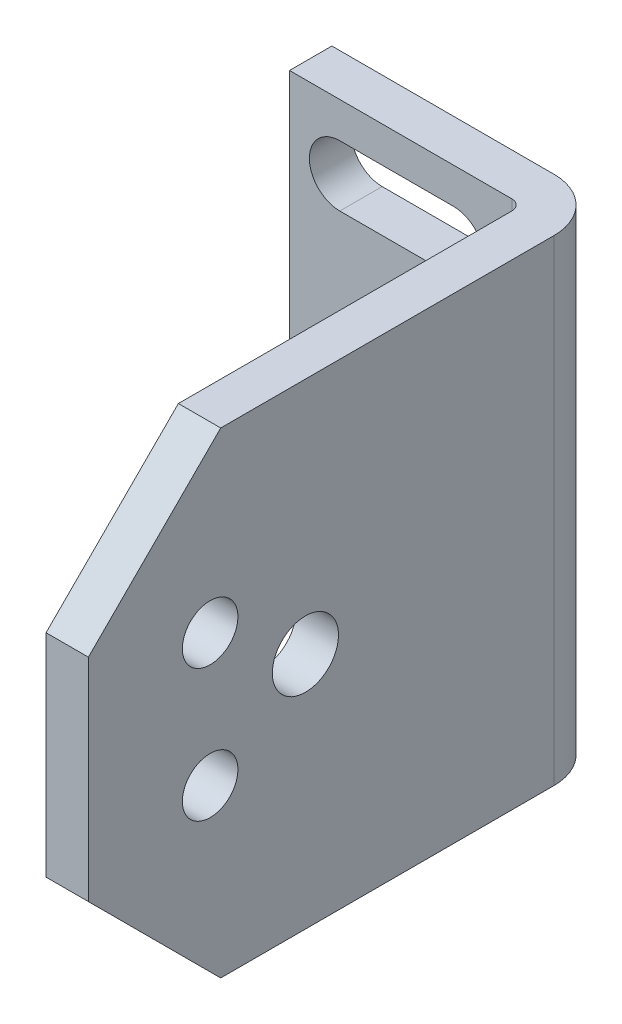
ISO-10303-21;
HEADER;
FILE_DESCRIPTION(('STEP AP214'),'2;1');
FILE_NAME('part.step','',(''),(''),'','','');
FILE_SCHEMA(('AUTOMOTIVE_DESIGN { 1 0 10303 214 1 1 1 1 }'));
ENDSEC;
DATA;
#1=APPLICATION_CONTEXT('core data for automotive mechanical design processes');
#2=APPLICATION_PROTOCOL_DEFINITION('international standard','automotive_design',2000,#1);
#3=PRODUCT_CONTEXT('',#1,'mechanical');
#4=PRODUCT('Part','Part','',(#3));
#5=PRODUCT_RELATED_PRODUCT_CATEGORY('part','',(#4));
#6=PRODUCT_DEFINITION_FORMATION('','',#4);
#7=PRODUCT_DEFINITION_CONTEXT('part definition',#1,'design');
#8=PRODUCT_DEFINITION('design','',#6,#7);
#9=PRODUCT_DEFINITION_SHAPE('','',#8);
#10=(LENGTH_UNIT() NAMED_UNIT(*) SI_UNIT(.MILLI.,.METRE.));
#11=(NAMED_UNIT(*) PLANE_ANGLE_UNIT() SI_UNIT($,.RADIAN.));
#12=(NAMED_UNIT(*) SI_UNIT($,.STERADIAN.) SOLID_ANGLE_UNIT());
#13=UNCERTAINTY_MEASURE_WITH_UNIT(LENGTH_MEASURE(1.E-05),#10,'distance_accuracy_value','');
#14=(GEOMETRIC_REPRESENTATION_CONTEXT(3) GLOBAL_UNCERTAINTY_ASSIGNED_CONTEXT((#13)) GLOBAL_UNIT_ASSIGNED_CONTEXT((#10,
#11,#12)) REPRESENTATION_CONTEXT('',''));
#15=CARTESIAN_POINT('',(0.,0.,0.));
#16=DIRECTION('',(0.,0.,1.));
#17=DIRECTION('',(1.,0.,0.));
#18=AXIS2_PLACEMENT_3D('',#15,#16,#17);
#19=CARTESIAN_POINT('',(34.5,77.5,98.));
#20=DIRECTION('',(0.,0.,-1.));
#21=DIRECTION('',(-1.,0.,0.));
#22=AXIS2_PLACEMENT_3D('',#19,#20,#21);
#23=PLANE('',#22);
#24=DIRECTION('',(0.,-1.,0.));
#25=VECTOR('',#24,1.);
#26=CARTESIAN_POINT('',(42.5,77.5,98.));
#27=LINE('',#26,#25);
#28=CARTESIAN_POINT('',(42.5,52.5,98.));
#29=VERTEX_POINT('',#28);
#30=CARTESIAN_POINT('',(42.5,12.5,98.));
#31=VERTEX_POINT('',#30);
#32=EDGE_CURVE('E252',#29,#31,#27,.T.);
#33=ORIENTED_EDGE('',*,*,#32,.F.);
#34=DIRECTION('',(-1.,0.,0.));
#35=VECTOR('',#34,1.);
#36=CARTESIAN_POINT('',(34.5,52.5,98.));
#37=LINE('',#36,#35);
#38=CARTESIAN_POINT('',(34.5,52.5,98.));
#39=VERTEX_POINT('',#38);
#40=EDGE_CURVE('E265',#29,#39,#37,.T.);
#41=ORIENTED_EDGE('',*,*,#40,.T.);
#42=DIRECTION('',(0.,-1.,0.));
#43=VECTOR('',#42,1.);
#44=CARTESIAN_POINT('',(34.5,77.5,98.));
#45=LINE('',#44,#43);
#46=CARTESIAN_POINT('',(34.5,12.5,98.));
#47=VERTEX_POINT('',#46);
#48=EDGE_CURVE('E217',#39,#47,#45,.T.);
#49=ORIENTED_EDGE('',*,*,#48,.T.);
#50=DIRECTION('',(1.,0.,0.));
#51=VECTOR('',#50,1.);
#52=CARTESIAN_POINT('',(34.5,12.5,98.));
#53=LINE('',#52,#51);
#54=EDGE_CURVE('E262',#47,#31,#53,.T.);
#55=ORIENTED_EDGE('',*,*,#54,.T.);
#56=EDGE_LOOP('',(#33,#41,#49,#55));
#57=FACE_BOUND('',#56,.T.);
#58=ADVANCED_FACE('F14',(#57),#23,.F.);
#59=CARTESIAN_POINT('',(42.5,77.5,98.));
#60=DIRECTION('',(-1.,0.,0.));
#61=DIRECTION('',(0.,0.,1.));
#62=AXIS2_PLACEMENT_3D('',#59,#60,#61);
#63=PLANE('',#62);
#64=CARTESIAN_POINT('',(42.5,20.,75.));
#65=DIRECTION('',(1.,0.,0.));
#66=DIRECTION('',(0.,-1.,0.));
#67=AXIS2_PLACEMENT_3D('',#64,#65,#66);
#68=CIRCLE('',#67,5.25);
#69=CARTESIAN_POINT('',(42.5,14.75,75.));
#70=VERTEX_POINT('',#69);
#71=EDGE_CURVE('E182',#70,#70,#68,.T.);
#72=ORIENTED_EDGE('',*,*,#71,.F.);
#73=EDGE_LOOP('',(#72));
#74=FACE_BOUND('',#73,.T.);
#75=CARTESIAN_POINT('',(42.5,45.,75.));
#76=DIRECTION('',(1.,0.,0.));
#77=DIRECTION('',(0.,1.,0.));
#78=AXIS2_PLACEMENT_3D('',#75,#76,#77);
#79=CIRCLE('',#78,5.25);
#80=CARTESIAN_POINT('',(42.5,50.25,75.));
#81=VERTEX_POINT('',#80);
#82=EDGE_CURVE('E193',#81,#81,#79,.T.);
#83=ORIENTED_EDGE('',*,*,#82,.F.);
#84=EDGE_LOOP('',(#83));
#85=FACE_BOUND('',#84,.T.);
#86=CARTESIAN_POINT('',(42.5,32.5,57.));
#87=DIRECTION('',(1.,0.,0.));
#88=DIRECTION('',(0.,1.,0.));
#89=AXIS2_PLACEMENT_3D('',#86,#87,#88);
#90=CIRCLE('',#89,6.25);
#91=CARTESIAN_POINT('',(42.5,38.75,57.));
#92=VERTEX_POINT('',#91);
#93=EDGE_CURVE('E197',#92,#92,#90,.T.);
#94=ORIENTED_EDGE('',*,*,#93,.F.);
#95=EDGE_LOOP('',(#94));
#96=FACE_BOUND('',#95,.T.);
#97=DIRECTION('',(0.,0.,-1.));
#98=VECTOR('',#97,1.);
#99=CARTESIAN_POINT('',(42.5,77.5,98.));
#100=LINE('',#99,#98);
#101=CARTESIAN_POINT('',(42.5,77.5,73.));
#102=VERTEX_POINT('',#101);
#103=CARTESIAN_POINT('',(42.5,77.5,10.));
#104=VERTEX_POINT('',#103);
#105=EDGE_CURVE('E201',#102,#104,#100,.T.);
#106=ORIENTED_EDGE('',*,*,#105,.F.);
#107=DIRECTION('',(0.,-0.707106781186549,0.707106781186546));
#108=VECTOR('',#107,1.);
#109=CARTESIAN_POINT('',(42.5,77.5,73.));
#110=LINE('',#109,#108);
#111=EDGE_CURVE('E260',#102,#29,#110,.T.);
#112=ORIENTED_EDGE('',*,*,#111,.T.);
#113=ORIENTED_EDGE('',*,*,#32,.T.);
#114=DIRECTION('',(0.,0.707106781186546,0.707106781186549));
#115=VECTOR('',#114,1.);
#116=CARTESIAN_POINT('',(42.5,12.5,98.));
#117=LINE('',#116,#115);
#118=CARTESIAN_POINT('',(42.5,-12.5,73.));
#119=VERTEX_POINT('',#118);
#120=EDGE_CURVE('E258',#31,#119,#117,.F.);
#121=ORIENTED_EDGE('',*,*,#120,.T.);
#122=DIRECTION('',(0.,0.,-1.));
#123=VECTOR('',#122,1.);
#124=CARTESIAN_POINT('',(42.5,-12.5,98.));
#125=LINE('',#124,#123);
#126=CARTESIAN_POINT('',(42.5,-12.5,10.));
#127=VERTEX_POINT('',#126);
#128=EDGE_CURVE('E218',#119,#127,#125,.T.);
#129=ORIENTED_EDGE('',*,*,#128,.T.);
#130=DIRECTION('',(0.,-1.,0.));
#131=VECTOR('',#130,1.);
#132=CARTESIAN_POINT('',(42.5,77.5,10.));
#133=LINE('',#132,#131);
#134=EDGE_CURVE('E249',#104,#127,#133,.T.);
#135=ORIENTED_EDGE('',*,*,#134,.F.);
#136=EDGE_LOOP('',(#106,#112,#113,#121,#129,#135));
#137=FACE_BOUND('',#136,.T.);
#138=ADVANCED_FACE('F313',(#74,#85,#96,#137),#63,.F.);
#139=CARTESIAN_POINT('',(32.5,77.5,10.));
#140=DIRECTION('',(0.,-1.,0.));
#141=DIRECTION('',(1.,0.,0.));
#142=AXIS2_PLACEMENT_3D('',#139,#140,#141);
#143=CYLINDRICAL_SURFACE('',#142,10.);
#144=CARTESIAN_POINT('',(32.5,-12.5,10.));
#145=DIRECTION('',(0.,1.,0.));
#146=DIRECTION('',(-1.,0.,0.));
#147=AXIS2_PLACEMENT_3D('',#144,#145,#146);
#148=CIRCLE('',#147,10.);
#149=CARTESIAN_POINT('',(32.5,-12.5,0.));
#150=VERTEX_POINT('',#149);
#151=EDGE_CURVE('E220',#127,#150,#148,.T.);
#152=ORIENTED_EDGE('',*,*,#151,.T.);
#153=DIRECTION('',(0.,-1.,0.));
#154=VECTOR('',#153,1.);
#155=CARTESIAN_POINT('',(32.5,77.5,0.));
#156=LINE('',#155,#154);
#157=CARTESIAN_POINT('',(32.5,77.5,0.));
#158=VERTEX_POINT('',#157);
#159=EDGE_CURVE('E246',#158,#150,#156,.T.);
#160=ORIENTED_EDGE('',*,*,#159,.F.);
#161=CARTESIAN_POINT('',(32.5,77.5,10.));
#162=DIRECTION('',(0.,1.,0.));
#163=DIRECTION('',(-1.,0.,0.));
#164=AXIS2_PLACEMENT_3D('',#161,#162,#163);
#165=CIRCLE('',#164,10.);
#166=EDGE_CURVE('E203',#104,#158,#165,.T.);
#167=ORIENTED_EDGE('',*,*,#166,.F.);
#168=ORIENTED_EDGE('',*,*,#134,.T.);
#169=EDGE_LOOP('',(#152,#160,#167,#168));
#170=FACE_BOUND('',#169,.T.);
#171=ADVANCED_FACE('F320',(#170),#143,.T.);
#172=CARTESIAN_POINT('',(32.5,77.5,0.));
#173=DIRECTION('',(0.,0.,1.));
#174=DIRECTION('',(1.,0.,0.));
#175=AXIS2_PLACEMENT_3D('',#172,#173,#174);
#176=PLANE('',#175);
#177=DIRECTION('',(-1.,0.,0.));
#178=VECTOR('',#177,1.);
#179=CARTESIAN_POINT('',(21.5,5.75,0.));
#180=LINE('',#179,#178);
#181=CARTESIAN_POINT('',(21.5,5.75,0.));
#182=VERTEX_POINT('',#181);
#183=CARTESIAN_POINT('',(0.,5.75,0.));
#184=VERTEX_POINT('',#183);
#185=EDGE_CURVE('E146',#182,#184,#180,.T.);
#186=ORIENTED_EDGE('',*,*,#185,.T.);
#187=CARTESIAN_POINT('',(0.,0.,0.));
#188=DIRECTION('',(0.,0.,1.));
#189=DIRECTION('',(-1.,0.,0.));
#190=AXIS2_PLACEMENT_3D('',#187,#188,#189);
#191=CIRCLE('',#190,5.75);
#192=CARTESIAN_POINT('',(0.,-5.75,0.));
#193=VERTEX_POINT('',#192);
#194=EDGE_CURVE('E142',#184,#193,#191,.T.);
#195=ORIENTED_EDGE('',*,*,#194,.T.);
#196=DIRECTION('',(1.,0.,0.));
#197=VECTOR('',#196,1.);
#198=CARTESIAN_POINT('',(21.5,-5.75,0.));
#199=LINE('',#198,#197);
#200=CARTESIAN_POINT('',(21.5,-5.75,0.));
#201=VERTEX_POINT('',#200);
#202=EDGE_CURVE('E149',#193,#201,#199,.T.);
#203=ORIENTED_EDGE('',*,*,#202,.T.);
#204=CARTESIAN_POINT('',(21.5,0.,0.));
#205=DIRECTION('',(0.,0.,1.));
#206=DIRECTION('',(-1.,0.,0.));
#207=AXIS2_PLACEMENT_3D('',#204,#205,#206);
#208=CIRCLE('',#207,5.75);
#209=EDGE_CURVE('E29',#201,#182,#208,.T.);
#210=ORIENTED_EDGE('',*,*,#209,.T.);
#211=EDGE_LOOP('',(#186,#195,#203,#210));
#212=FACE_BOUND('',#211,.T.);
#213=DIRECTION('',(1.,0.,0.));
#214=VECTOR('',#213,1.);
#215=CARTESIAN_POINT('',(21.5,59.25,0.));
#216=LINE('',#215,#214);
#217=CARTESIAN_POINT('',(0.,59.25,0.));
#218=VERTEX_POINT('',#217);
#219=CARTESIAN_POINT('',(21.5,59.25,0.));
#220=VERTEX_POINT('',#219);
#221=EDGE_CURVE('E175',#218,#220,#216,.T.);
#222=ORIENTED_EDGE('',*,*,#221,.T.);
#223=CARTESIAN_POINT('',(21.5,65.,0.));
#224=DIRECTION('',(0.,0.,1.));
#225=DIRECTION('',(1.,0.,0.));
#226=AXIS2_PLACEMENT_3D('',#223,#224,#225);
#227=CIRCLE('',#226,5.75);
#228=CARTESIAN_POINT('',(21.5,70.75,0.));
#229=VERTEX_POINT('',#228);
#230=EDGE_CURVE('E162',#220,#229,#227,.T.);
#231=ORIENTED_EDGE('',*,*,#230,.T.);
#232=DIRECTION('',(-1.,0.,0.));
#233=VECTOR('',#232,1.);
#234=CARTESIAN_POINT('',(21.5,70.75,0.));
#235=LINE('',#234,#233);
#236=CARTESIAN_POINT('',(0.,70.75,0.));
#237=VERTEX_POINT('',#236);
#238=EDGE_CURVE('E169',#229,#237,#235,.T.);
#239=ORIENTED_EDGE('',*,*,#238,.T.);
#240=CARTESIAN_POINT('',(0.,65.,0.));
#241=DIRECTION('',(0.,0.,1.));
#242=DIRECTION('',(1.,0.,0.));
#243=AXIS2_PLACEMENT_3D('',#240,#241,#242);
#244=CIRCLE('',#243,5.75);
#245=EDGE_CURVE('E172',#237,#218,#244,.T.);
#246=ORIENTED_EDGE('',*,*,#245,.T.);
#247=EDGE_LOOP('',(#222,#231,#239,#246));
#248=FACE_BOUND('',#247,.T.);
#249=DIRECTION('',(-1.,0.,0.));
#250=VECTOR('',#249,1.);
#251=CARTESIAN_POINT('',(32.5,-12.5,0.));
#252=LINE('',#251,#250);
#253=CARTESIAN_POINT('',(-9.5,-12.5,0.));
#254=VERTEX_POINT('',#253);
#255=EDGE_CURVE('E222',#150,#254,#252,.T.);
#256=ORIENTED_EDGE('',*,*,#255,.T.);
#257=DIRECTION('',(0.,-1.,0.));
#258=VECTOR('',#257,1.);
#259=CARTESIAN_POINT('',(-9.5,77.5,0.));
#260=LINE('',#259,#258);
#261=CARTESIAN_POINT('',(-9.5,77.5,0.));
#262=VERTEX_POINT('',#261);
#263=EDGE_CURVE('E243',#262,#254,#260,.T.);
#264=ORIENTED_EDGE('',*,*,#263,.F.);
#265=DIRECTION('',(-1.,0.,0.));
#266=VECTOR('',#265,1.);
#267=CARTESIAN_POINT('',(32.5,77.5,0.));
#268=LINE('',#267,#266);
#269=EDGE_CURVE('E206',#158,#262,#268,.T.);
#270=ORIENTED_EDGE('',*,*,#269,.F.);
#271=ORIENTED_EDGE('',*,*,#159,.T.);
#272=EDGE_LOOP('',(#256,#264,#270,#271));
#273=FACE_BOUND('',#272,.T.);
#274=ADVANCED_FACE('F153',(#212,#248,#273),#176,.F.);
#275=CARTESIAN_POINT('',(-9.5,77.5,0.));
#276=DIRECTION('',(1.,0.,0.));
#277=DIRECTION('',(0.,1.,0.));
#278=AXIS2_PLACEMENT_3D('',#275,#276,#277);
#279=PLANE('',#278);
#280=DIRECTION('',(0.,0.,1.));
#281=VECTOR('',#280,1.);
#282=CARTESIAN_POINT('',(-9.5,-12.5,0.));
#283=LINE('',#282,#281);
#284=CARTESIAN_POINT('',(-9.5,-12.5,8.));
#285=VERTEX_POINT('',#284);
#286=EDGE_CURVE('E224',#254,#285,#283,.T.);
#287=ORIENTED_EDGE('',*,*,#286,.T.);
#288=DIRECTION('',(0.,-1.,0.));
#289=VECTOR('',#288,1.);
#290=CARTESIAN_POINT('',(-9.5,77.5,8.));
#291=LINE('',#290,#289);
#292=CARTESIAN_POINT('',(-9.5,77.5,8.));
#293=VERTEX_POINT('',#292);
#294=EDGE_CURVE('E240',#293,#285,#291,.T.);
#295=ORIENTED_EDGE('',*,*,#294,.F.);
#296=DIRECTION('',(0.,0.,1.));
#297=VECTOR('',#296,1.);
#298=CARTESIAN_POINT('',(-9.5,77.5,0.));
#299=LINE('',#298,#297);
#300=EDGE_CURVE('E208',#262,#293,#299,.T.);
#301=ORIENTED_EDGE('',*,*,#300,.F.);
#302=ORIENTED_EDGE('',*,*,#263,.T.);
#303=EDGE_LOOP('',(#287,#295,#301,#302));
#304=FACE_BOUND('',#303,.T.);
#305=ADVANCED_FACE('F375',(#304),#279,.F.);
#306=CARTESIAN_POINT('',(-9.5,77.5,8.));
#307=DIRECTION('',(0.,0.,-1.));
#308=DIRECTION('',(-1.,0.,0.));
#309=AXIS2_PLACEMENT_3D('',#306,#307,#308);
#310=PLANE('',#309);
#311=DIRECTION('',(-1.,0.,0.));
#312=VECTOR('',#311,1.);
#313=CARTESIAN_POINT('',(-9.5,-5.75,8.));
#314=LINE('',#313,#312);
#315=CARTESIAN_POINT('',(21.5,-5.75,8.));
#316=VERTEX_POINT('',#315);
#317=CARTESIAN_POINT('',(0.,-5.75,8.));
#318=VERTEX_POINT('',#317);
#319=EDGE_CURVE('E291',#316,#318,#314,.T.);
#320=ORIENTED_EDGE('',*,*,#319,.T.);
#321=CARTESIAN_POINT('',(0.,0.,8.));
#322=DIRECTION('',(0.,0.,-1.));
#323=DIRECTION('',(-1.,0.,0.));
#324=AXIS2_PLACEMENT_3D('',#321,#322,#323);
#325=CIRCLE('',#324,5.75);
#326=CARTESIAN_POINT('',(0.,5.75,8.));
#327=VERTEX_POINT('',#326);
#328=EDGE_CURVE('E9',#318,#327,#325,.T.);
#329=ORIENTED_EDGE('',*,*,#328,.T.);
#330=DIRECTION('',(1.,0.,0.));
#331=VECTOR('',#330,1.);
#332=CARTESIAN_POINT('',(-9.5,5.75,8.));
#333=LINE('',#332,#331);
#334=CARTESIAN_POINT('',(21.5,5.75,8.));
#335=VERTEX_POINT('',#334);
#336=EDGE_CURVE('E22',#327,#335,#333,.T.);
#337=ORIENTED_EDGE('',*,*,#336,.T.);
#338=CARTESIAN_POINT('',(21.5,0.,8.));
#339=DIRECTION('',(0.,0.,-1.));
#340=DIRECTION('',(-1.,0.,0.));
#341=AXIS2_PLACEMENT_3D('',#338,#339,#340);
#342=CIRCLE('',#341,5.75);
#343=EDGE_CURVE('E293',#335,#316,#342,.T.);
#344=ORIENTED_EDGE('',*,*,#343,.T.);
#345=EDGE_LOOP('',(#320,#329,#337,#344));
#346=FACE_BOUND('',#345,.T.);
#347=DIRECTION('',(1.,0.,0.));
#348=VECTOR('',#347,1.);
#349=CARTESIAN_POINT('',(-9.5,70.75,8.));
#350=LINE('',#349,#348);
#351=CARTESIAN_POINT('',(0.,70.75,8.));
#352=VERTEX_POINT('',#351);
#353=CARTESIAN_POINT('',(21.5,70.75,8.));
#354=VERTEX_POINT('',#353);
#355=EDGE_CURVE('E273',#352,#354,#350,.T.);
#356=ORIENTED_EDGE('',*,*,#355,.T.);
#357=CARTESIAN_POINT('',(21.5,65.,8.));
#358=DIRECTION('',(0.,0.,-1.));
#359=DIRECTION('',(-1.,0.,0.));
#360=AXIS2_PLACEMENT_3D('',#357,#358,#359);
#361=CIRCLE('',#360,5.75);
#362=CARTESIAN_POINT('',(21.5,59.25,8.));
#363=VERTEX_POINT('',#362);
#364=EDGE_CURVE('E288',#354,#363,#361,.T.);
#365=ORIENTED_EDGE('',*,*,#364,.T.);
#366=DIRECTION('',(-1.,0.,0.));
#367=VECTOR('',#366,1.);
#368=CARTESIAN_POINT('',(-9.5,59.25,8.));
#369=LINE('',#368,#367);
#370=CARTESIAN_POINT('',(0.,59.25,8.));
#371=VERTEX_POINT('',#370);
#372=EDGE_CURVE('E285',#363,#371,#369,.T.);
#373=ORIENTED_EDGE('',*,*,#372,.T.);
#374=CARTESIAN_POINT('',(0.,65.,8.));
#375=DIRECTION('',(0.,0.,-1.));
#376=DIRECTION('',(-1.,0.,0.));
#377=AXIS2_PLACEMENT_3D('',#374,#375,#376);
#378=CIRCLE('',#377,5.75);
#379=EDGE_CURVE('E282',#371,#352,#378,.T.);
#380=ORIENTED_EDGE('',*,*,#379,.T.);
#381=EDGE_LOOP('',(#356,#365,#373,#380));
#382=FACE_BOUND('',#381,.T.);
#383=DIRECTION('',(1.,0.,0.));
#384=VECTOR('',#383,1.);
#385=CARTESIAN_POINT('',(-9.5,-12.5,8.));
#386=LINE('',#385,#384);
#387=CARTESIAN_POINT('',(32.5,-12.5,8.));
#388=VERTEX_POINT('',#387);
#389=EDGE_CURVE('E226',#285,#388,#386,.T.);
#390=ORIENTED_EDGE('',*,*,#389,.T.);
#391=DIRECTION('',(0.,-1.,0.));
#392=VECTOR('',#391,1.);
#393=CARTESIAN_POINT('',(32.5,77.5,8.));
#394=LINE('',#393,#392);
#395=CARTESIAN_POINT('',(32.5,77.5,8.));
#396=VERTEX_POINT('',#395);
#397=EDGE_CURVE('E237',#396,#388,#394,.T.);
#398=ORIENTED_EDGE('',*,*,#397,.F.);
#399=DIRECTION('',(1.,0.,0.));
#400=VECTOR('',#399,1.);
#401=CARTESIAN_POINT('',(-9.5,77.5,8.));
#402=LINE('',#401,#400);
#403=EDGE_CURVE('E210',#293,#396,#402,.T.);
#404=ORIENTED_EDGE('',*,*,#403,.F.);
#405=ORIENTED_EDGE('',*,*,#294,.T.);
#406=EDGE_LOOP('',(#390,#398,#404,#405));
#407=FACE_BOUND('',#406,.T.);
#408=ADVANCED_FACE('F297',(#346,#382,#407),#310,.F.);
#409=CARTESIAN_POINT('',(32.5,77.5,10.));
#410=DIRECTION('',(0.,-1.,0.));
#411=DIRECTION('',(1.,0.,0.));
#412=AXIS2_PLACEMENT_3D('',#409,#410,#411);
#413=CYLINDRICAL_SURFACE('',#412,2.);
#414=CARTESIAN_POINT('',(32.5,-12.5,10.));
#415=DIRECTION('',(0.,-1.,0.));
#416=DIRECTION('',(-1.,0.,0.));
#417=AXIS2_PLACEMENT_3D('',#414,#415,#416);
#418=CIRCLE('',#417,2.);
#419=CARTESIAN_POINT('',(34.5,-12.5,10.));
#420=VERTEX_POINT('',#419);
#421=EDGE_CURVE('E228',#388,#420,#418,.T.);
#422=ORIENTED_EDGE('',*,*,#421,.T.);
#423=DIRECTION('',(0.,-1.,0.));
#424=VECTOR('',#423,1.);
#425=CARTESIAN_POINT('',(34.5,77.5,10.));
#426=LINE('',#425,#424);
#427=CARTESIAN_POINT('',(34.5,77.5,10.));
#428=VERTEX_POINT('',#427);
#429=EDGE_CURVE('E234',#428,#420,#426,.T.);
#430=ORIENTED_EDGE('',*,*,#429,.F.);
#431=CARTESIAN_POINT('',(32.5,77.5,10.));
#432=DIRECTION('',(0.,-1.,0.));
#433=DIRECTION('',(-1.,0.,0.));
#434=AXIS2_PLACEMENT_3D('',#431,#432,#433);
#435=CIRCLE('',#434,2.);
#436=EDGE_CURVE('E212',#396,#428,#435,.T.);
#437=ORIENTED_EDGE('',*,*,#436,.F.);
#438=ORIENTED_EDGE('',*,*,#397,.T.);
#439=EDGE_LOOP('',(#422,#430,#437,#438));
#440=FACE_BOUND('',#439,.T.);
#441=ADVANCED_FACE('F353',(#440),#413,.F.);
#442=CARTESIAN_POINT('',(34.5,77.5,10.));
#443=DIRECTION('',(1.,0.,0.));
#444=DIRECTION('',(0.,1.,0.));
#445=AXIS2_PLACEMENT_3D('',#442,#443,#444);
#446=PLANE('',#445);
#447=CARTESIAN_POINT('',(34.5,20.,75.));
#448=DIRECTION('',(1.,0.,0.));
#449=DIRECTION('',(0.,1.,0.));
#450=AXIS2_PLACEMENT_3D('',#447,#448,#449);
#451=CIRCLE('',#450,5.25);
#452=CARTESIAN_POINT('',(34.5,25.25,75.));
#453=VERTEX_POINT('',#452);
#454=EDGE_CURVE('E192',#453,#453,#451,.T.);
#455=ORIENTED_EDGE('',*,*,#454,.T.);
#456=EDGE_LOOP('',(#455));
#457=FACE_BOUND('',#456,.T.);
#458=CARTESIAN_POINT('',(34.5,45.,75.));
#459=DIRECTION('',(1.,0.,0.));
#460=DIRECTION('',(0.,1.,0.));
#461=AXIS2_PLACEMENT_3D('',#458,#459,#460);
#462=CIRCLE('',#461,5.25);
#463=CARTESIAN_POINT('',(34.5,50.25,75.));
#464=VERTEX_POINT('',#463);
#465=EDGE_CURVE('E196',#464,#464,#462,.T.);
#466=ORIENTED_EDGE('',*,*,#465,.T.);
#467=EDGE_LOOP('',(#466));
#468=FACE_BOUND('',#467,.T.);
#469=CARTESIAN_POINT('',(34.5,32.5,57.));
#470=DIRECTION('',(1.,0.,0.));
#471=DIRECTION('',(0.,1.,0.));
#472=AXIS2_PLACEMENT_3D('',#469,#470,#471);
#473=CIRCLE('',#472,6.25);
#474=CARTESIAN_POINT('',(34.5,38.75,57.));
#475=VERTEX_POINT('',#474);
#476=EDGE_CURVE('E200',#475,#475,#473,.T.);
#477=ORIENTED_EDGE('',*,*,#476,.T.);
#478=EDGE_LOOP('',(#477));
#479=FACE_BOUND('',#478,.T.);
#480=ORIENTED_EDGE('',*,*,#48,.F.);
#481=DIRECTION('',(0.,0.707106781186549,-0.707106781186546));
#482=VECTOR('',#481,1.);
#483=CARTESIAN_POINT('',(34.5,77.5,73.));
#484=LINE('',#483,#482);
#485=CARTESIAN_POINT('',(34.5,77.5,73.));
#486=VERTEX_POINT('',#485);
#487=EDGE_CURVE('E269',#39,#486,#484,.T.);
#488=ORIENTED_EDGE('',*,*,#487,.T.);
#489=DIRECTION('',(0.,0.,1.));
#490=VECTOR('',#489,1.);
#491=CARTESIAN_POINT('',(34.5,77.5,10.));
#492=LINE('',#491,#490);
#493=EDGE_CURVE('E214',#428,#486,#492,.T.);
#494=ORIENTED_EDGE('',*,*,#493,.F.);
#495=ORIENTED_EDGE('',*,*,#429,.T.);
#496=DIRECTION('',(0.,0.,1.));
#497=VECTOR('',#496,1.);
#498=CARTESIAN_POINT('',(34.5,-12.5,10.));
#499=LINE('',#498,#497);
#500=CARTESIAN_POINT('',(34.5,-12.5,73.));
#501=VERTEX_POINT('',#500);
#502=EDGE_CURVE('E204',#420,#501,#499,.T.);
#503=ORIENTED_EDGE('',*,*,#502,.T.);
#504=DIRECTION('',(0.,-0.707106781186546,-0.707106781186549));
#505=VECTOR('',#504,1.);
#506=CARTESIAN_POINT('',(34.5,12.5,98.));
#507=LINE('',#506,#505);
#508=EDGE_CURVE('E267',#501,#47,#507,.F.);
#509=ORIENTED_EDGE('',*,*,#508,.T.);
#510=EDGE_LOOP('',(#480,#488,#494,#495,#503,#509));
#511=FACE_BOUND('',#510,.T.);
#512=ADVANCED_FACE('F345',(#457,#468,#479,#511),#446,.F.);
#513=CARTESIAN_POINT('',(32.5,77.5,10.));
#514=DIRECTION('',(0.,1.,0.));
#515=DIRECTION('',(-1.,0.,0.));
#516=AXIS2_PLACEMENT_3D('',#513,#514,#515);
#517=PLANE('',#516);
#518=ORIENTED_EDGE('',*,*,#493,.T.);
#519=DIRECTION('',(1.,0.,0.));
#520=VECTOR('',#519,1.);
#521=CARTESIAN_POINT('',(42.5,77.5,73.));
#522=LINE('',#521,#520);
#523=EDGE_CURVE('E255',#486,#102,#522,.T.);
#524=ORIENTED_EDGE('',*,*,#523,.T.);
#525=ORIENTED_EDGE('',*,*,#105,.T.);
#526=ORIENTED_EDGE('',*,*,#166,.T.);
#527=ORIENTED_EDGE('',*,*,#269,.T.);
#528=ORIENTED_EDGE('',*,*,#300,.T.);
#529=ORIENTED_EDGE('',*,*,#403,.T.);
#530=ORIENTED_EDGE('',*,*,#436,.T.);
#531=EDGE_LOOP('',(#518,#524,#525,#526,#527,#528,#529,#530));
#532=FACE_BOUND('',#531,.T.);
#533=ADVANCED_FACE('F336',(#532),#517,.T.);
#534=CARTESIAN_POINT('',(32.5,-12.5,10.));
#535=DIRECTION('',(0.,1.,0.));
#536=DIRECTION('',(-1.,0.,0.));
#537=AXIS2_PLACEMENT_3D('',#534,#535,#536);
#538=PLANE('',#537);
#539=ORIENTED_EDGE('',*,*,#128,.F.);
#540=DIRECTION('',(-1.,0.,0.));
#541=VECTOR('',#540,1.);
#542=CARTESIAN_POINT('',(32.5,-12.5,73.));
#543=LINE('',#542,#541);
#544=EDGE_CURVE('E271',#119,#501,#543,.T.);
#545=ORIENTED_EDGE('',*,*,#544,.T.);
#546=ORIENTED_EDGE('',*,*,#502,.F.);
#547=ORIENTED_EDGE('',*,*,#421,.F.);
#548=ORIENTED_EDGE('',*,*,#389,.F.);
#549=ORIENTED_EDGE('',*,*,#286,.F.);
#550=ORIENTED_EDGE('',*,*,#255,.F.);
#551=ORIENTED_EDGE('',*,*,#151,.F.);
#552=EDGE_LOOP('',(#539,#545,#546,#547,#548,#549,#550,#551));
#553=FACE_BOUND('',#552,.T.);
#554=ADVANCED_FACE('F327',(#553),#538,.F.);
#555=CARTESIAN_POINT('',(32.5,77.5,73.));
#556=DIRECTION('',(0.,0.707106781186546,0.707106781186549));
#557=DIRECTION('',(0.,-0.707106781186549,0.707106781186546));
#558=AXIS2_PLACEMENT_3D('',#555,#556,#557);
#559=PLANE('',#558);
#560=ORIENTED_EDGE('',*,*,#487,.F.);
#561=ORIENTED_EDGE('',*,*,#40,.F.);
#562=ORIENTED_EDGE('',*,*,#111,.F.);
#563=ORIENTED_EDGE('',*,*,#523,.F.);
#564=EDGE_LOOP('',(#560,#561,#562,#563));
#565=FACE_BOUND('',#564,.T.);
#566=ADVANCED_FACE('F325',(#565),#559,.T.);
#567=CARTESIAN_POINT('',(34.5,12.5,98.));
#568=DIRECTION('',(0.,0.707106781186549,-0.707106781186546));
#569=DIRECTION('',(0.,0.707106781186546,0.707106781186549));
#570=AXIS2_PLACEMENT_3D('',#567,#568,#569);
#571=PLANE('',#570);
#572=ORIENTED_EDGE('',*,*,#508,.F.);
#573=ORIENTED_EDGE('',*,*,#544,.F.);
#574=ORIENTED_EDGE('',*,*,#120,.F.);
#575=ORIENTED_EDGE('',*,*,#54,.F.);
#576=EDGE_LOOP('',(#572,#573,#574,#575));
#577=FACE_BOUND('',#576,.T.);
#578=ADVANCED_FACE('F16',(#577),#571,.F.);
#579=CARTESIAN_POINT('',(-9.5,32.5,57.));
#580=DIRECTION('',(1.,0.,0.));
#581=DIRECTION('',(0.,1.,0.));
#582=AXIS2_PLACEMENT_3D('',#579,#580,#581);
#583=CYLINDRICAL_SURFACE('',#582,6.25);
#584=ORIENTED_EDGE('',*,*,#93,.T.);
#585=EDGE_LOOP('',(#584));
#586=FACE_BOUND('',#585,.T.);
#587=ORIENTED_EDGE('',*,*,#476,.F.);
#588=EDGE_LOOP('',(#587));
#589=FACE_BOUND('',#588,.T.);
#590=ADVANCED_FACE('F334',(#586,#589),#583,.F.);
#591=CARTESIAN_POINT('',(-9.5,45.,75.));
#592=DIRECTION('',(1.,0.,0.));
#593=DIRECTION('',(0.,1.,0.));
#594=AXIS2_PLACEMENT_3D('',#591,#592,#593);
#595=CYLINDRICAL_SURFACE('',#594,5.25);
#596=ORIENTED_EDGE('',*,*,#82,.T.);
#597=EDGE_LOOP('',(#596));
#598=FACE_BOUND('',#597,.T.);
#599=ORIENTED_EDGE('',*,*,#465,.F.);
#600=EDGE_LOOP('',(#599));
#601=FACE_BOUND('',#600,.T.);
#602=ADVANCED_FACE('F517',(#598,#601),#595,.F.);
#603=CARTESIAN_POINT('',(-9.5,20.,75.));
#604=DIRECTION('',(1.,0.,0.));
#605=DIRECTION('',(0.,1.,0.));
#606=AXIS2_PLACEMENT_3D('',#603,#604,#605);
#607=CYLINDRICAL_SURFACE('',#606,5.25);
#608=ORIENTED_EDGE('',*,*,#71,.T.);
#609=EDGE_LOOP('',(#608));
#610=FACE_BOUND('',#609,.T.);
#611=ORIENTED_EDGE('',*,*,#454,.F.);
#612=EDGE_LOOP('',(#611));
#613=FACE_BOUND('',#612,.T.);
#614=ADVANCED_FACE('F508',(#610,#613),#607,.F.);
#615=CARTESIAN_POINT('',(21.5,65.,0.));
#616=DIRECTION('',(0.,0.,1.));
#617=DIRECTION('',(1.,0.,0.));
#618=AXIS2_PLACEMENT_3D('',#615,#616,#617);
#619=CYLINDRICAL_SURFACE('',#618,5.75);
#620=DIRECTION('',(0.,0.,1.));
#621=VECTOR('',#620,1.);
#622=CARTESIAN_POINT('',(21.5,70.75,0.));
#623=LINE('',#622,#621);
#624=EDGE_CURVE('E178',#229,#354,#623,.T.);
#625=ORIENTED_EDGE('',*,*,#624,.F.);
#626=ORIENTED_EDGE('',*,*,#230,.F.);
#627=DIRECTION('',(0.,0.,1.));
#628=VECTOR('',#627,1.);
#629=CARTESIAN_POINT('',(21.5,59.25,0.));
#630=LINE('',#629,#628);
#631=EDGE_CURVE('E179',#220,#363,#630,.T.);
#632=ORIENTED_EDGE('',*,*,#631,.T.);
#633=ORIENTED_EDGE('',*,*,#364,.F.);
#634=EDGE_LOOP('',(#625,#626,#632,#633));
#635=FACE_BOUND('',#634,.T.);
#636=ADVANCED_FACE('F499',(#635),#619,.F.);
#637=CARTESIAN_POINT('',(21.5,59.25,0.));
#638=DIRECTION('',(0.,-1.,0.));
#639=DIRECTION('',(1.,0.,0.));
#640=AXIS2_PLACEMENT_3D('',#637,#638,#639);
#641=PLANE('',#640);
#642=ORIENTED_EDGE('',*,*,#631,.F.);
#643=ORIENTED_EDGE('',*,*,#221,.F.);
#644=DIRECTION('',(0.,0.,1.));
#645=VECTOR('',#644,1.);
#646=CARTESIAN_POINT('',(0.,59.25,0.));
#647=LINE('',#646,#645);
#648=EDGE_CURVE('E183',#218,#371,#647,.T.);
#649=ORIENTED_EDGE('',*,*,#648,.T.);
#650=ORIENTED_EDGE('',*,*,#372,.F.);
#651=EDGE_LOOP('',(#642,#643,#649,#650));
#652=FACE_BOUND('',#651,.T.);
#653=ADVANCED_FACE('F490',(#652),#641,.F.);
#654=CARTESIAN_POINT('',(0.,65.,0.));
#655=DIRECTION('',(0.,0.,1.));
#656=DIRECTION('',(1.,0.,0.));
#657=AXIS2_PLACEMENT_3D('',#654,#655,#656);
#658=CYLINDRICAL_SURFACE('',#657,5.75);
#659=ORIENTED_EDGE('',*,*,#648,.F.);
#660=ORIENTED_EDGE('',*,*,#245,.F.);
#661=DIRECTION('',(0.,0.,1.));
#662=VECTOR('',#661,1.);
#663=CARTESIAN_POINT('',(0.,70.75,0.));
#664=LINE('',#663,#662);
#665=EDGE_CURVE('E186',#237,#352,#664,.T.);
#666=ORIENTED_EDGE('',*,*,#665,.T.);
#667=ORIENTED_EDGE('',*,*,#379,.F.);
#668=EDGE_LOOP('',(#659,#660,#666,#667));
#669=FACE_BOUND('',#668,.T.);
#670=ADVANCED_FACE('F481',(#669),#658,.F.);
#671=CARTESIAN_POINT('',(21.5,70.75,0.));
#672=DIRECTION('',(0.,1.,0.));
#673=DIRECTION('',(-1.,0.,0.));
#674=AXIS2_PLACEMENT_3D('',#671,#672,#673);
#675=PLANE('',#674);
#676=ORIENTED_EDGE('',*,*,#665,.F.);
#677=ORIENTED_EDGE('',*,*,#238,.F.);
#678=ORIENTED_EDGE('',*,*,#624,.T.);
#679=ORIENTED_EDGE('',*,*,#355,.F.);
#680=EDGE_LOOP('',(#676,#677,#678,#679));
#681=FACE_BOUND('',#680,.T.);
#682=ADVANCED_FACE('F474',(#681),#675,.F.);
#683=CARTESIAN_POINT('',(0.,0.,0.));
#684=DIRECTION('',(0.,0.,1.));
#685=DIRECTION('',(1.,0.,0.));
#686=AXIS2_PLACEMENT_3D('',#683,#684,#685);
#687=CYLINDRICAL_SURFACE('',#686,5.75);
#688=DIRECTION('',(0.,0.,1.));
#689=VECTOR('',#688,1.);
#690=CARTESIAN_POINT('',(0.,-5.75,0.));
#691=LINE('',#690,#689);
#692=EDGE_CURVE('E37',#193,#318,#691,.T.);
#693=ORIENTED_EDGE('',*,*,#692,.F.);
#694=ORIENTED_EDGE('',*,*,#194,.F.);
#695=DIRECTION('',(0.,0.,1.));
#696=VECTOR('',#695,1.);
#697=CARTESIAN_POINT('',(0.,5.75,0.));
#698=LINE('',#697,#696);
#699=EDGE_CURVE('E160',#184,#327,#698,.T.);
#700=ORIENTED_EDGE('',*,*,#699,.T.);
#701=ORIENTED_EDGE('',*,*,#328,.F.);
#702=EDGE_LOOP('',(#693,#694,#700,#701));
#703=FACE_BOUND('',#702,.T.);
#704=ADVANCED_FACE('F139',(#703),#687,.F.);
#705=CARTESIAN_POINT('',(21.5,5.75,0.));
#706=DIRECTION('',(0.,1.,0.));
#707=DIRECTION('',(-1.,0.,0.));
#708=AXIS2_PLACEMENT_3D('',#705,#706,#707);
#709=PLANE('',#708);
#710=ORIENTED_EDGE('',*,*,#699,.F.);
#711=ORIENTED_EDGE('',*,*,#185,.F.);
#712=DIRECTION('',(0.,0.,1.));
#713=VECTOR('',#712,1.);
#714=CARTESIAN_POINT('',(21.5,5.75,0.));
#715=LINE('',#714,#713);
#716=EDGE_CURVE('E163',#182,#335,#715,.T.);
#717=ORIENTED_EDGE('',*,*,#716,.T.);
#718=ORIENTED_EDGE('',*,*,#336,.F.);
#719=EDGE_LOOP('',(#710,#711,#717,#718));
#720=FACE_BOUND('',#719,.T.);
#721=ADVANCED_FACE('F300',(#720),#709,.F.);
#722=CARTESIAN_POINT('',(21.5,0.,0.));
#723=DIRECTION('',(0.,0.,1.));
#724=DIRECTION('',(1.,0.,0.));
#725=AXIS2_PLACEMENT_3D('',#722,#723,#724);
#726=CYLINDRICAL_SURFACE('',#725,5.75);
#727=ORIENTED_EDGE('',*,*,#716,.F.);
#728=ORIENTED_EDGE('',*,*,#209,.F.);
#729=DIRECTION('',(0.,0.,1.));
#730=VECTOR('',#729,1.);
#731=CARTESIAN_POINT('',(21.5,-5.75,0.));
#732=LINE('',#731,#730);
#733=EDGE_CURVE('E145',#201,#316,#732,.T.);
#734=ORIENTED_EDGE('',*,*,#733,.T.);
#735=ORIENTED_EDGE('',*,*,#343,.F.);
#736=EDGE_LOOP('',(#727,#728,#734,#735));
#737=FACE_BOUND('',#736,.T.);
#738=ADVANCED_FACE('F301',(#737),#726,.F.);
#739=CARTESIAN_POINT('',(21.5,-5.75,0.));
#740=DIRECTION('',(0.,-1.,0.));
#741=DIRECTION('',(1.,0.,0.));
#742=AXIS2_PLACEMENT_3D('',#739,#740,#741);
#743=PLANE('',#742);
#744=ORIENTED_EDGE('',*,*,#733,.F.);
#745=ORIENTED_EDGE('',*,*,#202,.F.);
#746=ORIENTED_EDGE('',*,*,#692,.T.);
#747=ORIENTED_EDGE('',*,*,#319,.F.);
#748=EDGE_LOOP('',(#744,#745,#746,#747));
#749=FACE_BOUND('',#748,.T.);
#750=ADVANCED_FACE('F150',(#749),#743,.F.);
#751=CLOSED_SHELL('',(#58,#138,#171,#274,#305,#408,#441,#512,#533,#554,#566,#578,#590,#602,#614,
#636,#653,#670,#682,#704,#721,#738,#750));
#752=MANIFOLD_SOLID_BREP('B1',#751);
#753=ADVANCED_BREP_SHAPE_REPRESENTATION('',(#18,#752),#14);
#754=SHAPE_DEFINITION_REPRESENTATION(#9,#753);
ENDSEC;
END-ISO-10303-21;
